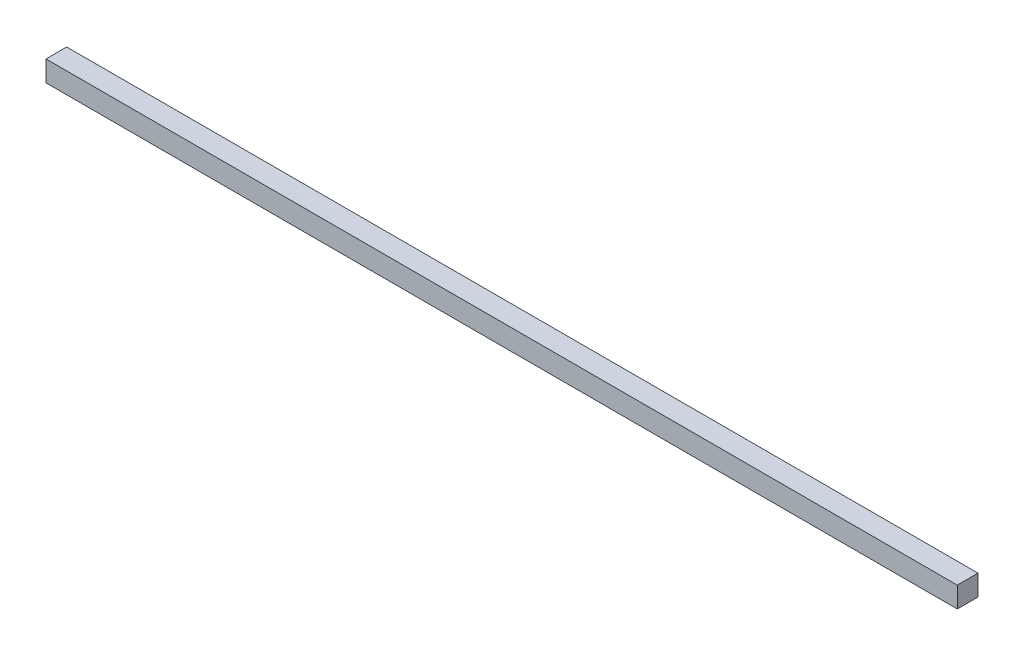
from build123d import *

# Parameters (mm, degrees)
SKETCH_1_W      = 10
SKETCH_1_H      = 10
EXTRUDE_1_DEPTH = 440


with BuildPart() as part:
    # Sketch 1 → Extrude 1 (new body)
    with BuildSketch(Plane.YZ):
        Rectangle(SKETCH_1_W, SKETCH_1_H)
    extrude(amount=EXTRUDE_1_DEPTH)


solid = part.part
